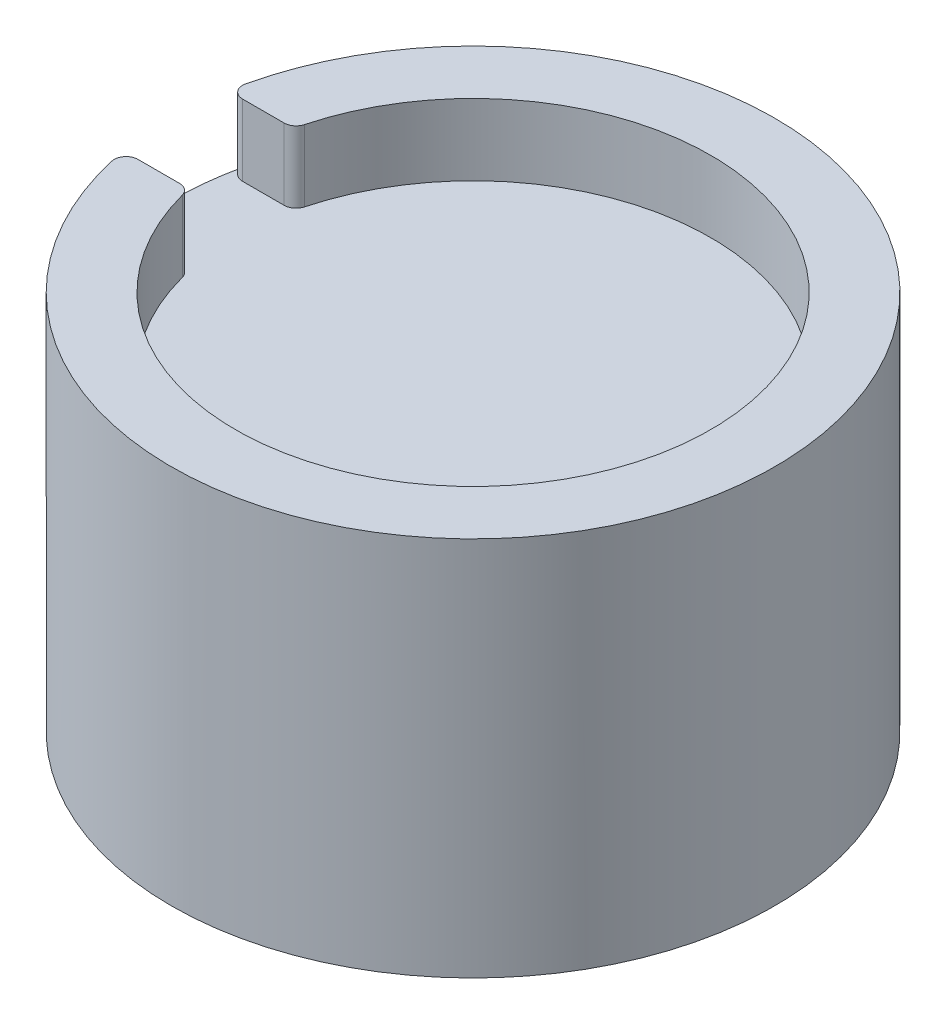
ISO-10303-21;
HEADER;
FILE_DESCRIPTION(('STEP AP214'),'2;1');
FILE_NAME('part.step','',(''),(''),'','','');
FILE_SCHEMA(('AUTOMOTIVE_DESIGN { 1 0 10303 214 1 1 1 1 }'));
ENDSEC;
DATA;
#1=APPLICATION_CONTEXT('core data for automotive mechanical design processes');
#2=APPLICATION_PROTOCOL_DEFINITION('international standard','automotive_design',2000,#1);
#3=PRODUCT_CONTEXT('',#1,'mechanical');
#4=PRODUCT('Part','Part','',(#3));
#5=PRODUCT_RELATED_PRODUCT_CATEGORY('part','',(#4));
#6=PRODUCT_DEFINITION_FORMATION('','',#4);
#7=PRODUCT_DEFINITION_CONTEXT('part definition',#1,'design');
#8=PRODUCT_DEFINITION('design','',#6,#7);
#9=PRODUCT_DEFINITION_SHAPE('','',#8);
#10=(LENGTH_UNIT() NAMED_UNIT(*) SI_UNIT(.MILLI.,.METRE.));
#11=(NAMED_UNIT(*) PLANE_ANGLE_UNIT() SI_UNIT($,.RADIAN.));
#12=(NAMED_UNIT(*) SI_UNIT($,.STERADIAN.) SOLID_ANGLE_UNIT());
#13=UNCERTAINTY_MEASURE_WITH_UNIT(LENGTH_MEASURE(1.E-05),#10,'distance_accuracy_value','');
#14=(GEOMETRIC_REPRESENTATION_CONTEXT(3) GLOBAL_UNCERTAINTY_ASSIGNED_CONTEXT((#13)) GLOBAL_UNIT_ASSIGNED_CONTEXT((#10,
#11,#12)) REPRESENTATION_CONTEXT('',''));
#15=CARTESIAN_POINT('',(0.,0.,0.));
#16=DIRECTION('',(0.,0.,1.));
#17=DIRECTION('',(1.,0.,0.));
#18=AXIS2_PLACEMENT_3D('',#15,#16,#17);
#19=CARTESIAN_POINT('',(0.,4.,0.));
#20=DIRECTION('',(0.,-1.,0.));
#21=DIRECTION('',(0.,0.,-1.));
#22=AXIS2_PLACEMENT_3D('',#19,#20,#21);
#23=CYLINDRICAL_SURFACE('',#22,6.35);
#24=CARTESIAN_POINT('',(0.,4.,0.));
#25=DIRECTION('',(0.,1.,0.));
#26=DIRECTION('',(0.,0.,1.));
#27=AXIS2_PLACEMENT_3D('',#24,#25,#26);
#28=CIRCLE('',#27,6.35);
#29=CARTESIAN_POINT('',(-6.19254015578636,4.,1.40532786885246));
#30=VERTEX_POINT('',#29);
#31=CARTESIAN_POINT('',(-6.19254015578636,4.,-1.40532786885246));
#32=VERTEX_POINT('',#31);
#33=EDGE_CURVE('E134',#30,#32,#28,.T.);
#34=ORIENTED_EDGE('',*,*,#33,.F.);
#35=DIRECTION('',(0.,-1.,0.));
#36=VECTOR('',#35,1.);
#37=CARTESIAN_POINT('',(-6.19254015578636,4.,1.40532786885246));
#38=LINE('',#37,#36);
#39=CARTESIAN_POINT('',(-6.19254015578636,2.5,1.40532786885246));
#40=VERTEX_POINT('',#39);
#41=EDGE_CURVE('E103',#30,#40,#38,.T.);
#42=ORIENTED_EDGE('',*,*,#41,.T.);
#43=CARTESIAN_POINT('',(0.,2.5,0.));
#44=DIRECTION('',(0.,1.,0.));
#45=DIRECTION('',(0.,0.,1.));
#46=AXIS2_PLACEMENT_3D('',#43,#44,#45);
#47=CIRCLE('',#46,6.35);
#48=CARTESIAN_POINT('',(-6.19254015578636,2.5,-1.40532786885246));
#49=VERTEX_POINT('',#48);
#50=EDGE_CURVE('E163',#49,#40,#47,.T.);
#51=ORIENTED_EDGE('',*,*,#50,.F.);
#52=DIRECTION('',(0.,-1.,0.));
#53=VECTOR('',#52,1.);
#54=CARTESIAN_POINT('',(-6.19254015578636,4.,-1.40532786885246));
#55=LINE('',#54,#53);
#56=EDGE_CURVE('E108',#49,#32,#55,.F.);
#57=ORIENTED_EDGE('',*,*,#56,.T.);
#58=EDGE_LOOP('',(#34,#42,#51,#57));
#59=FACE_BOUND('',#58,.T.);
#60=CARTESIAN_POINT('',(0.,-4.,0.));
#61=DIRECTION('',(0.,1.,0.));
#62=DIRECTION('',(0.,0.,1.));
#63=AXIS2_PLACEMENT_3D('',#60,#61,#62);
#64=CIRCLE('',#63,6.35);
#65=CARTESIAN_POINT('',(0.,-4.,6.35));
#66=VERTEX_POINT('',#65);
#67=EDGE_CURVE('E136',#66,#66,#64,.T.);
#68=ORIENTED_EDGE('',*,*,#67,.T.);
#69=EDGE_LOOP('',(#68));
#70=FACE_BOUND('',#69,.T.);
#71=ADVANCED_FACE('F32',(#59,#70),#23,.T.);
#72=CARTESIAN_POINT('',(0.,4.,0.));
#73=DIRECTION('',(0.,1.,0.));
#74=DIRECTION('',(0.,0.,1.));
#75=AXIS2_PLACEMENT_3D('',#72,#73,#74);
#76=PLANE('',#75);
#77=DIRECTION('',(1.,0.,0.));
#78=VECTOR('',#77,1.);
#79=CARTESIAN_POINT('',(-4.87749935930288,4.,1.1));
#80=LINE('',#79,#78);
#81=CARTESIAN_POINT('',(-5.94873936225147,4.,1.1));
#82=VERTEX_POINT('',#81);
#83=CARTESIAN_POINT('',(-5.07346035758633,4.,1.1));
#84=VERTEX_POINT('',#83);
#85=EDGE_CURVE('E115',#82,#84,#80,.T.);
#86=ORIENTED_EDGE('',*,*,#85,.F.);
#87=CARTESIAN_POINT('',(-5.94873936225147,4.,1.35));
#88=DIRECTION('',(0.,1.,0.));
#89=DIRECTION('',(0.,0.,1.));
#90=AXIS2_PLACEMENT_3D('',#87,#88,#89);
#91=CIRCLE('',#90,0.25);
#92=EDGE_CURVE('E97',#82,#30,#91,.T.);
#93=ORIENTED_EDGE('',*,*,#92,.T.);
#94=ORIENTED_EDGE('',*,*,#33,.T.);
#95=CARTESIAN_POINT('',(-5.94873936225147,4.,-1.35));
#96=DIRECTION('',(0.,1.,0.));
#97=DIRECTION('',(0.,0.,1.));
#98=AXIS2_PLACEMENT_3D('',#95,#96,#97);
#99=CIRCLE('',#98,0.25);
#100=CARTESIAN_POINT('',(-5.94873936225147,4.,-1.1));
#101=VERTEX_POINT('',#100);
#102=EDGE_CURVE('E109',#32,#101,#99,.T.);
#103=ORIENTED_EDGE('',*,*,#102,.T.);
#104=DIRECTION('',(-1.,0.,0.));
#105=VECTOR('',#104,1.);
#106=CARTESIAN_POINT('',(-4.87749935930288,4.,-1.1));
#107=LINE('',#106,#105);
#108=CARTESIAN_POINT('',(-5.07346035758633,4.,-1.1));
#109=VERTEX_POINT('',#108);
#110=EDGE_CURVE('E125',#109,#101,#107,.T.);
#111=ORIENTED_EDGE('',*,*,#110,.F.);
#112=CARTESIAN_POINT('',(-5.07346035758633,4.,-1.35));
#113=DIRECTION('',(0.,1.,0.));
#114=DIRECTION('',(0.,0.,1.));
#115=AXIS2_PLACEMENT_3D('',#112,#113,#114);
#116=CIRCLE('',#115,0.25);
#117=CARTESIAN_POINT('',(-4.83186700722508,4.,-1.28571428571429));
#118=VERTEX_POINT('',#117);
#119=EDGE_CURVE('E118',#109,#118,#116,.T.);
#120=ORIENTED_EDGE('',*,*,#119,.T.);
#121=CARTESIAN_POINT('',(0.,4.,0.));
#122=DIRECTION('',(0.,1.,0.));
#123=DIRECTION('',(0.,0.,1.));
#124=AXIS2_PLACEMENT_3D('',#121,#122,#123);
#125=CIRCLE('',#124,5.);
#126=CARTESIAN_POINT('',(-4.83186700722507,4.,1.28571428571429));
#127=VERTEX_POINT('',#126);
#128=EDGE_CURVE('E130',#127,#118,#125,.T.);
#129=ORIENTED_EDGE('',*,*,#128,.F.);
#130=CARTESIAN_POINT('',(-5.07346035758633,4.,1.35));
#131=DIRECTION('',(0.,1.,0.));
#132=DIRECTION('',(0.,0.,1.));
#133=AXIS2_PLACEMENT_3D('',#130,#131,#132);
#134=CIRCLE('',#133,0.25);
#135=EDGE_CURVE('E123',#127,#84,#134,.T.);
#136=ORIENTED_EDGE('',*,*,#135,.T.);
#137=EDGE_LOOP('',(#86,#93,#94,#103,#111,#120,#129,#136));
#138=FACE_BOUND('',#137,.T.);
#139=ADVANCED_FACE('F121',(#138),#76,.T.);
#140=CARTESIAN_POINT('',(0.,-4.,0.));
#141=DIRECTION('',(0.,1.,0.));
#142=DIRECTION('',(0.,0.,1.));
#143=AXIS2_PLACEMENT_3D('',#140,#141,#142);
#144=PLANE('',#143);
#145=CARTESIAN_POINT('',(0.,-4.,0.));
#146=DIRECTION('',(0.,-1.,0.));
#147=DIRECTION('',(0.,0.,-1.));
#148=AXIS2_PLACEMENT_3D('',#145,#146,#147);
#149=CIRCLE('',#148,1.5875);
#150=CARTESIAN_POINT('',(0.,-4.,-1.5875));
#151=VERTEX_POINT('',#150);
#152=EDGE_CURVE('E180',#151,#151,#149,.T.);
#153=ORIENTED_EDGE('',*,*,#152,.F.);
#154=EDGE_LOOP('',(#153));
#155=FACE_BOUND('',#154,.T.);
#156=ORIENTED_EDGE('',*,*,#67,.F.);
#157=EDGE_LOOP('',(#156));
#158=FACE_BOUND('',#157,.T.);
#159=ADVANCED_FACE('F191',(#155,#158),#144,.F.);
#160=CARTESIAN_POINT('',(0.,2.5,0.));
#161=DIRECTION('',(0.,1.,0.));
#162=DIRECTION('',(0.,0.,1.));
#163=AXIS2_PLACEMENT_3D('',#160,#161,#162);
#164=CYLINDRICAL_SURFACE('',#163,5.);
#165=CARTESIAN_POINT('',(0.,2.5,0.));
#166=DIRECTION('',(0.,1.,0.));
#167=DIRECTION('',(0.,0.,1.));
#168=AXIS2_PLACEMENT_3D('',#165,#166,#167);
#169=CIRCLE('',#168,5.);
#170=CARTESIAN_POINT('',(-4.83186700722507,2.5,1.28571428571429));
#171=VERTEX_POINT('',#170);
#172=CARTESIAN_POINT('',(-4.83186700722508,2.5,-1.28571428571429));
#173=VERTEX_POINT('',#172);
#174=EDGE_CURVE('E124',#171,#173,#169,.T.);
#175=ORIENTED_EDGE('',*,*,#174,.F.);
#176=DIRECTION('',(0.,1.,0.));
#177=VECTOR('',#176,1.);
#178=CARTESIAN_POINT('',(-4.83186700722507,2.5,1.28571428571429));
#179=LINE('',#178,#177);
#180=EDGE_CURVE('E152',#171,#127,#179,.T.);
#181=ORIENTED_EDGE('',*,*,#180,.T.);
#182=ORIENTED_EDGE('',*,*,#128,.T.);
#183=DIRECTION('',(0.,1.,0.));
#184=VECTOR('',#183,1.);
#185=CARTESIAN_POINT('',(-4.83186700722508,2.5,-1.28571428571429));
#186=LINE('',#185,#184);
#187=EDGE_CURVE('E47',#118,#173,#186,.F.);
#188=ORIENTED_EDGE('',*,*,#187,.T.);
#189=EDGE_LOOP('',(#175,#181,#182,#188));
#190=FACE_BOUND('',#189,.T.);
#191=ADVANCED_FACE('F176',(#190),#164,.F.);
#192=CARTESIAN_POINT('',(-4.87749935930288,2.5,1.1));
#193=DIRECTION('',(0.,0.,1.));
#194=DIRECTION('',(1.,0.,0.));
#195=AXIS2_PLACEMENT_3D('',#192,#193,#194);
#196=PLANE('',#195);
#197=DIRECTION('',(1.,0.,0.));
#198=VECTOR('',#197,1.);
#199=CARTESIAN_POINT('',(-4.87749935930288,2.5,1.1));
#200=LINE('',#199,#198);
#201=CARTESIAN_POINT('',(-5.94873936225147,2.5,1.1));
#202=VERTEX_POINT('',#201);
#203=CARTESIAN_POINT('',(-5.07346035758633,2.5,1.1));
#204=VERTEX_POINT('',#203);
#205=EDGE_CURVE('E117',#202,#204,#200,.T.);
#206=ORIENTED_EDGE('',*,*,#205,.F.);
#207=DIRECTION('',(0.,-1.,0.));
#208=VECTOR('',#207,1.);
#209=CARTESIAN_POINT('',(-5.94873936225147,2.5,1.1));
#210=LINE('',#209,#208);
#211=EDGE_CURVE('E101',#202,#82,#210,.F.);
#212=ORIENTED_EDGE('',*,*,#211,.T.);
#213=ORIENTED_EDGE('',*,*,#85,.T.);
#214=DIRECTION('',(0.,1.,0.));
#215=VECTOR('',#214,1.);
#216=CARTESIAN_POINT('',(-5.07346035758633,2.5,1.1));
#217=LINE('',#216,#215);
#218=EDGE_CURVE('E119',#84,#204,#217,.F.);
#219=ORIENTED_EDGE('',*,*,#218,.T.);
#220=EDGE_LOOP('',(#206,#212,#213,#219));
#221=FACE_BOUND('',#220,.T.);
#222=ADVANCED_FACE('F114',(#221),#196,.F.);
#223=CARTESIAN_POINT('',(-4.87749935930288,2.5,-1.1));
#224=DIRECTION('',(0.,0.,-1.));
#225=DIRECTION('',(-1.,0.,0.));
#226=AXIS2_PLACEMENT_3D('',#223,#224,#225);
#227=PLANE('',#226);
#228=ORIENTED_EDGE('',*,*,#110,.T.);
#229=DIRECTION('',(0.,-1.,0.));
#230=VECTOR('',#229,1.);
#231=CARTESIAN_POINT('',(-5.94873936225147,2.5,-1.1));
#232=LINE('',#231,#230);
#233=CARTESIAN_POINT('',(-5.94873936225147,2.5,-1.1));
#234=VERTEX_POINT('',#233);
#235=EDGE_CURVE('E149',#101,#234,#232,.T.);
#236=ORIENTED_EDGE('',*,*,#235,.T.);
#237=DIRECTION('',(-1.,0.,0.));
#238=VECTOR('',#237,1.);
#239=CARTESIAN_POINT('',(-4.87749935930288,2.5,-1.1));
#240=LINE('',#239,#238);
#241=CARTESIAN_POINT('',(-5.07346035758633,2.5,-1.1));
#242=VERTEX_POINT('',#241);
#243=EDGE_CURVE('E127',#242,#234,#240,.T.);
#244=ORIENTED_EDGE('',*,*,#243,.F.);
#245=DIRECTION('',(0.,1.,0.));
#246=VECTOR('',#245,1.);
#247=CARTESIAN_POINT('',(-5.07346035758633,2.5,-1.1));
#248=LINE('',#247,#246);
#249=EDGE_CURVE('E146',#242,#109,#248,.T.);
#250=ORIENTED_EDGE('',*,*,#249,.T.);
#251=EDGE_LOOP('',(#228,#236,#244,#250));
#252=FACE_BOUND('',#251,.T.);
#253=ADVANCED_FACE('F172',(#252),#227,.F.);
#254=CARTESIAN_POINT('',(0.,2.5,0.));
#255=DIRECTION('',(0.,1.,0.));
#256=DIRECTION('',(0.,0.,1.));
#257=AXIS2_PLACEMENT_3D('',#254,#255,#256);
#258=PLANE('',#257);
#259=ORIENTED_EDGE('',*,*,#205,.T.);
#260=CARTESIAN_POINT('',(-5.07346035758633,2.5,1.35));
#261=DIRECTION('',(0.,1.,0.));
#262=DIRECTION('',(0.,0.,1.));
#263=AXIS2_PLACEMENT_3D('',#260,#261,#262);
#264=CIRCLE('',#263,0.25);
#265=EDGE_CURVE('E40',#204,#171,#264,.F.);
#266=ORIENTED_EDGE('',*,*,#265,.T.);
#267=ORIENTED_EDGE('',*,*,#174,.T.);
#268=CARTESIAN_POINT('',(-5.07346035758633,2.5,-1.35));
#269=DIRECTION('',(0.,1.,0.));
#270=DIRECTION('',(0.,0.,1.));
#271=AXIS2_PLACEMENT_3D('',#268,#269,#270);
#272=CIRCLE('',#271,0.25);
#273=EDGE_CURVE('E11',#173,#242,#272,.F.);
#274=ORIENTED_EDGE('',*,*,#273,.T.);
#275=ORIENTED_EDGE('',*,*,#243,.T.);
#276=CARTESIAN_POINT('',(-5.94873936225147,2.5,-1.35));
#277=DIRECTION('',(0.,1.,0.));
#278=DIRECTION('',(0.,0.,1.));
#279=AXIS2_PLACEMENT_3D('',#276,#277,#278);
#280=CIRCLE('',#279,0.25);
#281=EDGE_CURVE('E157',#234,#49,#280,.F.);
#282=ORIENTED_EDGE('',*,*,#281,.T.);
#283=ORIENTED_EDGE('',*,*,#50,.T.);
#284=CARTESIAN_POINT('',(-5.94873936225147,2.5,1.35));
#285=DIRECTION('',(0.,1.,0.));
#286=DIRECTION('',(0.,0.,1.));
#287=AXIS2_PLACEMENT_3D('',#284,#285,#286);
#288=CIRCLE('',#287,0.25);
#289=EDGE_CURVE('E155',#40,#202,#288,.F.);
#290=ORIENTED_EDGE('',*,*,#289,.T.);
#291=EDGE_LOOP('',(#259,#266,#267,#274,#275,#282,#283,#290));
#292=FACE_BOUND('',#291,.T.);
#293=ADVANCED_FACE('F162',(#292),#258,.T.);
#294=CARTESIAN_POINT('',(-5.94873936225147,4.,1.35));
#295=DIRECTION('',(0.,-1.,0.));
#296=DIRECTION('',(0.,0.,-1.));
#297=AXIS2_PLACEMENT_3D('',#294,#295,#296);
#298=CYLINDRICAL_SURFACE('',#297,0.25);
#299=ORIENTED_EDGE('',*,*,#289,.F.);
#300=ORIENTED_EDGE('',*,*,#41,.F.);
#301=ORIENTED_EDGE('',*,*,#92,.F.);
#302=ORIENTED_EDGE('',*,*,#211,.F.);
#303=EDGE_LOOP('',(#299,#300,#301,#302));
#304=FACE_BOUND('',#303,.T.);
#305=ADVANCED_FACE('F100',(#304),#298,.T.);
#306=CARTESIAN_POINT('',(-5.94873936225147,4.,-1.35));
#307=DIRECTION('',(0.,-1.,0.));
#308=DIRECTION('',(0.,0.,-1.));
#309=AXIS2_PLACEMENT_3D('',#306,#307,#308);
#310=CYLINDRICAL_SURFACE('',#309,0.25);
#311=ORIENTED_EDGE('',*,*,#281,.F.);
#312=ORIENTED_EDGE('',*,*,#235,.F.);
#313=ORIENTED_EDGE('',*,*,#102,.F.);
#314=ORIENTED_EDGE('',*,*,#56,.F.);
#315=EDGE_LOOP('',(#311,#312,#313,#314));
#316=FACE_BOUND('',#315,.T.);
#317=ADVANCED_FACE('F167',(#316),#310,.T.);
#318=CARTESIAN_POINT('',(-5.07346035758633,2.5,1.35));
#319=DIRECTION('',(0.,1.,0.));
#320=DIRECTION('',(0.,0.,1.));
#321=AXIS2_PLACEMENT_3D('',#318,#319,#320);
#322=CYLINDRICAL_SURFACE('',#321,0.25);
#323=ORIENTED_EDGE('',*,*,#265,.F.);
#324=ORIENTED_EDGE('',*,*,#218,.F.);
#325=ORIENTED_EDGE('',*,*,#135,.F.);
#326=ORIENTED_EDGE('',*,*,#180,.F.);
#327=EDGE_LOOP('',(#323,#324,#325,#326));
#328=FACE_BOUND('',#327,.T.);
#329=ADVANCED_FACE('F206',(#328),#322,.T.);
#330=CARTESIAN_POINT('',(-5.07346035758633,2.5,-1.35));
#331=DIRECTION('',(0.,1.,0.));
#332=DIRECTION('',(0.,0.,1.));
#333=AXIS2_PLACEMENT_3D('',#330,#331,#332);
#334=CYLINDRICAL_SURFACE('',#333,0.25);
#335=ORIENTED_EDGE('',*,*,#273,.F.);
#336=ORIENTED_EDGE('',*,*,#187,.F.);
#337=ORIENTED_EDGE('',*,*,#119,.F.);
#338=ORIENTED_EDGE('',*,*,#249,.F.);
#339=EDGE_LOOP('',(#335,#336,#337,#338));
#340=FACE_BOUND('',#339,.T.);
#341=ADVANCED_FACE('F34',(#340),#334,.T.);
#342=CARTESIAN_POINT('',(0.,0.,0.));
#343=DIRECTION('',(0.,1.,0.));
#344=DIRECTION('',(0.,0.,1.));
#345=AXIS2_PLACEMENT_3D('',#342,#343,#344);
#346=PLANE('',#345);
#347=CARTESIAN_POINT('',(0.,0.,0.));
#348=DIRECTION('',(0.,-1.,0.));
#349=DIRECTION('',(0.,0.,-1.));
#350=AXIS2_PLACEMENT_3D('',#347,#348,#349);
#351=CIRCLE('',#350,1.5875);
#352=CARTESIAN_POINT('',(0.,0.,-1.5875));
#353=VERTEX_POINT('',#352);
#354=EDGE_CURVE('E178',#353,#353,#351,.T.);
#355=ORIENTED_EDGE('',*,*,#354,.T.);
#356=EDGE_LOOP('',(#355));
#357=FACE_BOUND('',#356,.T.);
#358=ADVANCED_FACE('F212',(#357),#346,.F.);
#359=CARTESIAN_POINT('',(0.,-4.,0.));
#360=DIRECTION('',(0.,-1.,0.));
#361=DIRECTION('',(0.,0.,-1.));
#362=AXIS2_PLACEMENT_3D('',#359,#360,#361);
#363=CYLINDRICAL_SURFACE('',#362,1.5875);
#364=ORIENTED_EDGE('',*,*,#354,.F.);
#365=EDGE_LOOP('',(#364));
#366=FACE_BOUND('',#365,.T.);
#367=ORIENTED_EDGE('',*,*,#152,.T.);
#368=EDGE_LOOP('',(#367));
#369=FACE_BOUND('',#368,.T.);
#370=ADVANCED_FACE('F189',(#366,#369),#363,.F.);
#371=CLOSED_SHELL('',(#71,#139,#159,#191,#222,#253,#293,#305,#317,#329,#341,#358,#370));
#372=MANIFOLD_SOLID_BREP('B2',#371);
#373=ADVANCED_BREP_SHAPE_REPRESENTATION('',(#18,#372),#14);
#374=SHAPE_DEFINITION_REPRESENTATION(#9,#373);
ENDSEC;
END-ISO-10303-21;
